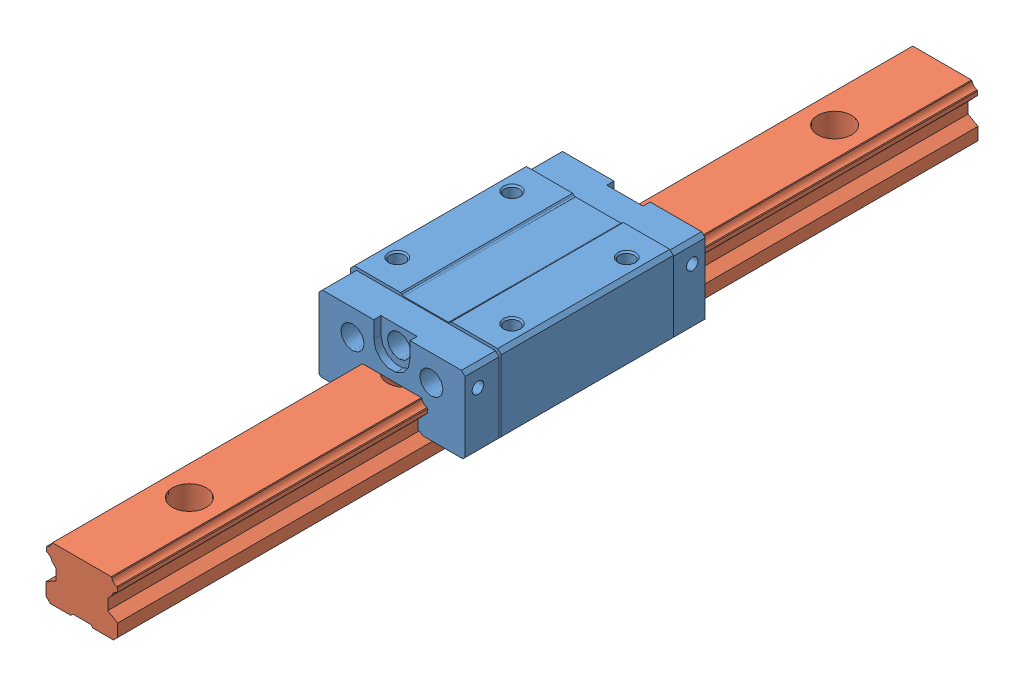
SolidWorks assembly IAS01-H28-L240.sldasm, configuration Default (file format 13000). Lengths in mm.
Overall size (42 28 240).
2 component instances, 2 part files, 0 mates.
Components (placement in the parent):
- ELH20CA-1: ELH20CA.SLDPRT [Default] at (0 28 -86.5) size (42 22 67)
- ELR20R240 E=30-1: ELR20R240 E=30.SLDPRT [Default] at (0 28 0) size (20 15 240)
